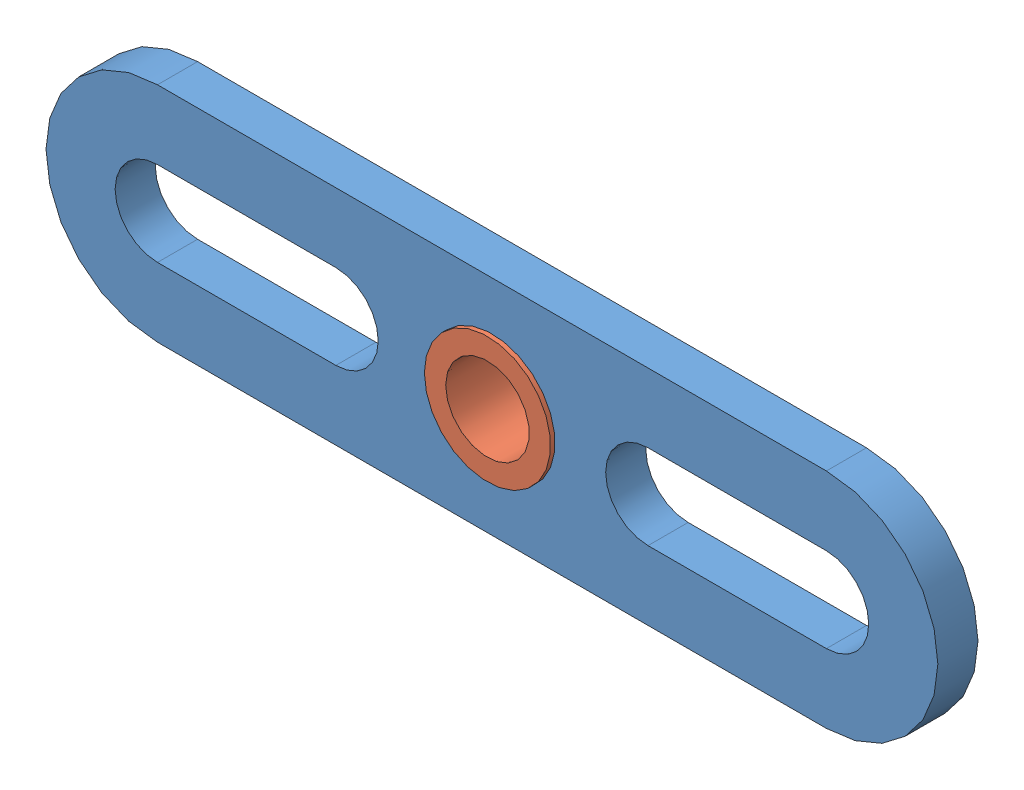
SolidWorks assembly bearingplate-bushing.sldasm, configuration Default (file format 3100). Lengths in mm.
Overall size (50.8 12.7 3.81).
2 component instances, 2 part files, 2 mates.
Components (placement in the parent):
- BushingBracket-1: BushingBracket.SLDPRT [Default] at origin size (50.8 12.7 2.29)
- bushing-1: bushing.SLDPRT [Default] at (0 0 -1.27) x (0 1 0) z (1 0 0) size (10.16 3.81 10.16)
Mates (geometry in assembly coordinates):
- Coincident1: coincident aligned: plane of BushingBracket-1 through (-19.05 0 0) normal (0 0 -1); circle of bushing-1 centre (0 0 0) axis (0 0 -1)
- Concentric1: concentric anti-aligned: cylinder of BushingBracket-1; cylinder of bushing-1
